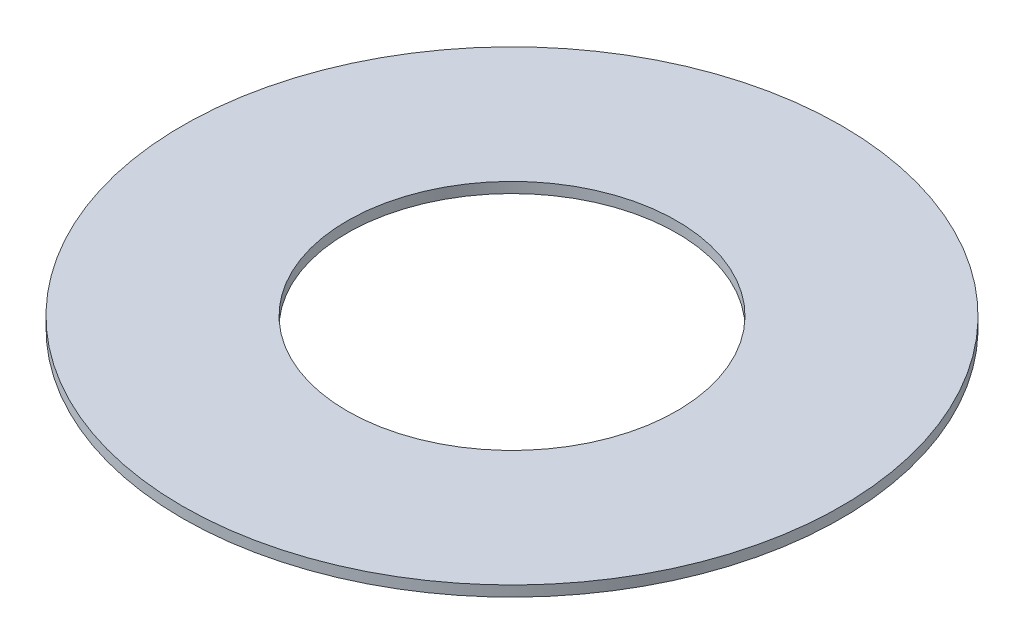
from build123d import *

# Parameters (mm, degrees)
SKETCH1_R           = 3.175
BOSS_EXTRUDE1_DEPTH = 0.1016
SKETCH5_R           = 1.5875
CUT_EXTRUDE1_DEPTH  = 5.491277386


with BuildPart() as part:
    # Sketch1 → Boss-Extrude1 (new body)
    with BuildSketch(Plane(origin=(0, 0, 0), x_dir=(1, 0, 0), z_dir=(0, 1, 0))):
        with Locations(Location((0, 0, 0), (0, 0, 270))):
            Circle(SKETCH1_R)
    extrude(amount=BOSS_EXTRUDE1_DEPTH)

    # Sketch5 → Cut-Extrude1 (cut, through all)
    with BuildSketch(Plane(origin=(0, 0.1016, 0), x_dir=(-1, 0, 0), z_dir=(0, 1, 0))):
        with Locations(Location((0, 0, 0), (0, 0, 90))):
            Circle(SKETCH5_R)
    extrude(amount=-CUT_EXTRUDE1_DEPTH, mode=Mode.SUBTRACT)


solid = part.part
